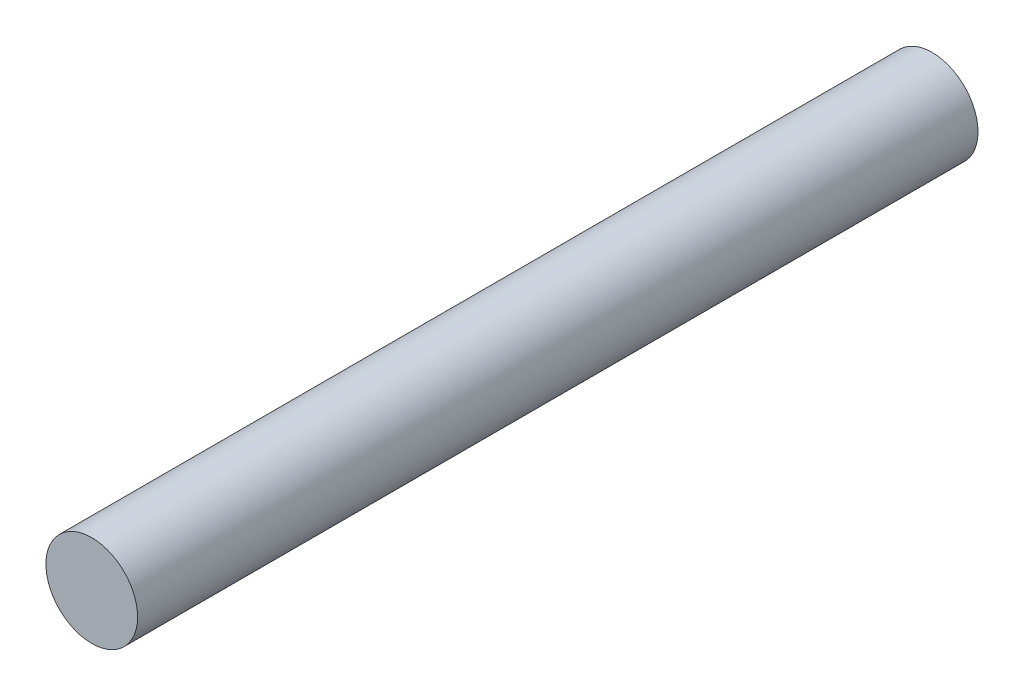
from build123d import *

# Parameters (mm, degrees)
SKETCH1_R           = 30
BOSS_EXTRUDE1_DEPTH = 550


with BuildPart() as part:
    # Sketch1 → Boss-Extrude1 (new body)
    with BuildSketch(Plane.XY):
        Circle(SKETCH1_R)
    extrude(amount=-BOSS_EXTRUDE1_DEPTH)


solid = part.part
